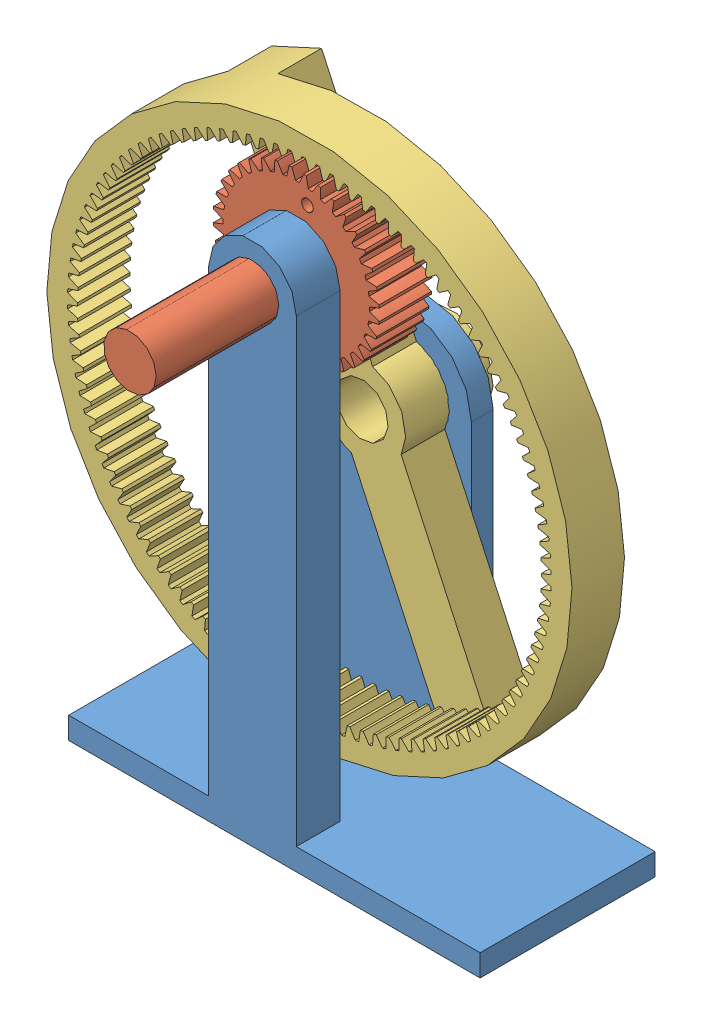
SolidWorks assembly reducteurint-cor.SLDASM, configuration Défaut (file format 6000). Lengths in mm.
Overall size (159.16 159.16 73).
3 component instances, 3 part files, 4 mates.
Components (placement in the parent):
- bati-1: bati.SLDPRT [Défaut] at (2.4134 35.3696 0) size (94 120 40)
- pignon1(36)-1: pignon1(36).SLDPRT [Défaut] at (2.4134 71.3696 0) x (0 0 -1) z (0.981734 -0.19026 0) size (50 37.9 37.9)
- couronne(108)-1: couronne(108).SLDPRT [Défaut] at (2.4134 35.3696 -15) x (0 0 1) z (-0.908573 -0.417726 0) size (32 120 120)
Mates (geometry in assembly coordinates):
- Coaxiale2: concentric aligned: cylinder of bati-1 through (2.4134 71.3696 10) axis (0 0 -1) radius 6; cylinder of pignon1(36)-1 through (2.4134 71.3696 38) axis (0 0 -1) radius 6
- Coïncidente2: coincident anti-aligned: plane of bati-1 through (2.4134 71.3696 0) normal (0 0 -1); plane of pignon1(36)-1 through (2.4134 71.3696 0) normal (0 0 1)
- Coaxiale3: concentric anti-aligned: cylinder of bati-1 through (2.4134 35.3696 -25) axis (0 0 -1) radius 15; cylinder of couronne(108)-1 through (2.4134 35.3696 -35) axis (0 0 1) radius 10
- Coïncidente3: coincident anti-aligned: plane of bati-1 through (2.4134 35.3696 -25) normal (0 0 1); plane of couronne(108)-1 through (2.4134 35.3696 -25) normal (0 0 -1)
